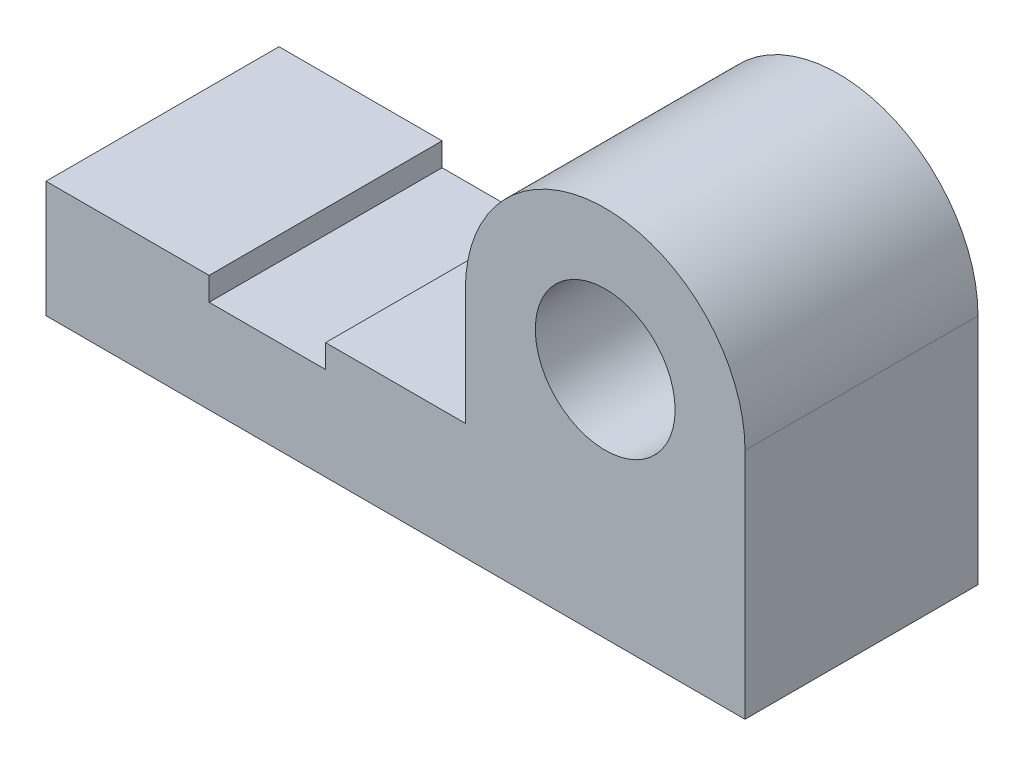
ISO-10303-21;
HEADER;
FILE_DESCRIPTION(('STEP AP214'),'2;1');
FILE_NAME('part.step','',(''),(''),'','','');
FILE_SCHEMA(('AUTOMOTIVE_DESIGN { 1 0 10303 214 1 1 1 1 }'));
ENDSEC;
DATA;
#1=APPLICATION_CONTEXT('core data for automotive mechanical design processes');
#2=APPLICATION_PROTOCOL_DEFINITION('international standard','automotive_design',2000,#1);
#3=PRODUCT_CONTEXT('',#1,'mechanical');
#4=PRODUCT('Part','Part','',(#3));
#5=PRODUCT_RELATED_PRODUCT_CATEGORY('part','',(#4));
#6=PRODUCT_DEFINITION_FORMATION('','',#4);
#7=PRODUCT_DEFINITION_CONTEXT('part definition',#1,'design');
#8=PRODUCT_DEFINITION('design','',#6,#7);
#9=PRODUCT_DEFINITION_SHAPE('','',#8);
#10=(LENGTH_UNIT() NAMED_UNIT(*) SI_UNIT(.MILLI.,.METRE.));
#11=(NAMED_UNIT(*) PLANE_ANGLE_UNIT() SI_UNIT($,.RADIAN.));
#12=(NAMED_UNIT(*) SI_UNIT($,.STERADIAN.) SOLID_ANGLE_UNIT());
#13=UNCERTAINTY_MEASURE_WITH_UNIT(LENGTH_MEASURE(1.E-05),#10,'distance_accuracy_value','');
#14=(GEOMETRIC_REPRESENTATION_CONTEXT(3) GLOBAL_UNCERTAINTY_ASSIGNED_CONTEXT((#13)) GLOBAL_UNIT_ASSIGNED_CONTEXT((#10,
#11,#12)) REPRESENTATION_CONTEXT('',''));
#15=CARTESIAN_POINT('',(0.,0.,0.));
#16=DIRECTION('',(0.,0.,1.));
#17=DIRECTION('',(1.,0.,0.));
#18=AXIS2_PLACEMENT_3D('',#15,#16,#17);
#19=CARTESIAN_POINT('',(240.,100.,100.));
#20=DIRECTION('',(0.,0.,1.));
#21=DIRECTION('',(1.,0.,0.));
#22=AXIS2_PLACEMENT_3D('',#19,#20,#21);
#23=PLANE('',#22);
#24=DIRECTION('',(0.,-1.,0.));
#25=VECTOR('',#24,1.);
#26=CARTESIAN_POINT('',(120.,50.,100.));
#27=LINE('',#26,#25);
#28=CARTESIAN_POINT('',(120.,50.,100.));
#29=VERTEX_POINT('',#28);
#30=CARTESIAN_POINT('',(120.,40.,100.));
#31=VERTEX_POINT('',#30);
#32=EDGE_CURVE('E193',#29,#31,#27,.T.);
#33=ORIENTED_EDGE('',*,*,#32,.T.);
#34=DIRECTION('',(-1.,0.,0.));
#35=VECTOR('',#34,1.);
#36=CARTESIAN_POINT('',(120.,40.,100.));
#37=LINE('',#36,#35);
#38=CARTESIAN_POINT('',(70.,40.,100.));
#39=VERTEX_POINT('',#38);
#40=EDGE_CURVE('E131',#31,#39,#37,.T.);
#41=ORIENTED_EDGE('',*,*,#40,.T.);
#42=DIRECTION('',(0.,1.,0.));
#43=VECTOR('',#42,1.);
#44=CARTESIAN_POINT('',(70.,40.,100.));
#45=LINE('',#44,#43);
#46=CARTESIAN_POINT('',(70.,50.,100.));
#47=VERTEX_POINT('',#46);
#48=EDGE_CURVE('E214',#39,#47,#45,.T.);
#49=ORIENTED_EDGE('',*,*,#48,.T.);
#50=DIRECTION('',(-1.,0.,0.));
#51=VECTOR('',#50,1.);
#52=CARTESIAN_POINT('',(70.,50.,100.));
#53=LINE('',#52,#51);
#54=CARTESIAN_POINT('',(0.,50.,100.));
#55=VERTEX_POINT('',#54);
#56=EDGE_CURVE('E233',#47,#55,#53,.T.);
#57=ORIENTED_EDGE('',*,*,#56,.T.);
#58=DIRECTION('',(0.,-1.,0.));
#59=VECTOR('',#58,1.);
#60=CARTESIAN_POINT('',(0.,50.,100.));
#61=LINE('',#60,#59);
#62=CARTESIAN_POINT('',(0.,0.,100.));
#63=VERTEX_POINT('',#62);
#64=EDGE_CURVE('E230',#55,#63,#61,.T.);
#65=ORIENTED_EDGE('',*,*,#64,.T.);
#66=DIRECTION('',(1.,0.,0.));
#67=VECTOR('',#66,1.);
#68=CARTESIAN_POINT('',(0.,0.,100.));
#69=LINE('',#68,#67);
#70=CARTESIAN_POINT('',(300.,0.,100.));
#71=VERTEX_POINT('',#70);
#72=EDGE_CURVE('E232',#63,#71,#69,.T.);
#73=ORIENTED_EDGE('',*,*,#72,.T.);
#74=DIRECTION('',(0.,1.,0.));
#75=VECTOR('',#74,1.);
#76=CARTESIAN_POINT('',(300.,0.,100.));
#77=LINE('',#76,#75);
#78=CARTESIAN_POINT('',(300.,100.,100.));
#79=VERTEX_POINT('',#78);
#80=EDGE_CURVE('E156',#71,#79,#77,.T.);
#81=ORIENTED_EDGE('',*,*,#80,.T.);
#82=CARTESIAN_POINT('',(240.,100.,100.));
#83=DIRECTION('',(0.,0.,1.));
#84=DIRECTION('',(1.,0.,0.));
#85=AXIS2_PLACEMENT_3D('',#82,#83,#84);
#86=CIRCLE('',#85,59.9999999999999);
#87=CARTESIAN_POINT('',(180.,100.,100.));
#88=VERTEX_POINT('',#87);
#89=EDGE_CURVE('E150',#79,#88,#86,.T.);
#90=ORIENTED_EDGE('',*,*,#89,.T.);
#91=DIRECTION('',(0.,-1.,0.));
#92=VECTOR('',#91,1.);
#93=CARTESIAN_POINT('',(180.,100.,100.));
#94=LINE('',#93,#92);
#95=CARTESIAN_POINT('',(180.,50.,100.));
#96=VERTEX_POINT('',#95);
#97=EDGE_CURVE('E154',#88,#96,#94,.T.);
#98=ORIENTED_EDGE('',*,*,#97,.T.);
#99=DIRECTION('',(-1.,0.,0.));
#100=VECTOR('',#99,1.);
#101=CARTESIAN_POINT('',(180.,50.,100.));
#102=LINE('',#101,#100);
#103=EDGE_CURVE('E82',#96,#29,#102,.T.);
#104=ORIENTED_EDGE('',*,*,#103,.T.);
#105=EDGE_LOOP('',(#33,#41,#49,#57,#65,#73,#81,#90,#98,#104));
#106=FACE_BOUND('',#105,.T.);
#107=CARTESIAN_POINT('',(240.,100.,100.));
#108=DIRECTION('',(0.,0.,1.));
#109=DIRECTION('',(1.,0.,0.));
#110=AXIS2_PLACEMENT_3D('',#107,#108,#109);
#111=CIRCLE('',#110,30.);
#112=CARTESIAN_POINT('',(270.,100.,100.));
#113=VERTEX_POINT('',#112);
#114=EDGE_CURVE('E178',#113,#113,#111,.T.);
#115=ORIENTED_EDGE('',*,*,#114,.F.);
#116=EDGE_LOOP('',(#115));
#117=FACE_BOUND('',#116,.T.);
#118=ADVANCED_FACE('F65',(#106,#117),#23,.T.);
#119=CARTESIAN_POINT('',(240.,100.,0.));
#120=DIRECTION('',(0.,0.,1.));
#121=DIRECTION('',(1.,0.,0.));
#122=AXIS2_PLACEMENT_3D('',#119,#120,#121);
#123=PLANE('',#122);
#124=DIRECTION('',(0.,-1.,0.));
#125=VECTOR('',#124,1.);
#126=CARTESIAN_POINT('',(120.,50.,0.));
#127=LINE('',#126,#125);
#128=CARTESIAN_POINT('',(120.,50.,0.));
#129=VERTEX_POINT('',#128);
#130=CARTESIAN_POINT('',(120.,40.,0.));
#131=VERTEX_POINT('',#130);
#132=EDGE_CURVE('E174',#129,#131,#127,.T.);
#133=ORIENTED_EDGE('',*,*,#132,.F.);
#134=DIRECTION('',(-1.,0.,0.));
#135=VECTOR('',#134,1.);
#136=CARTESIAN_POINT('',(180.,50.,0.));
#137=LINE('',#136,#135);
#138=CARTESIAN_POINT('',(180.,50.,0.));
#139=VERTEX_POINT('',#138);
#140=EDGE_CURVE('E123',#139,#129,#137,.T.);
#141=ORIENTED_EDGE('',*,*,#140,.F.);
#142=DIRECTION('',(0.,-1.,0.));
#143=VECTOR('',#142,1.);
#144=CARTESIAN_POINT('',(180.,100.,0.));
#145=LINE('',#144,#143);
#146=CARTESIAN_POINT('',(180.,100.,0.));
#147=VERTEX_POINT('',#146);
#148=EDGE_CURVE('E117',#147,#139,#145,.T.);
#149=ORIENTED_EDGE('',*,*,#148,.F.);
#150=CARTESIAN_POINT('',(240.,100.,0.));
#151=DIRECTION('',(0.,0.,1.));
#152=DIRECTION('',(1.,0.,0.));
#153=AXIS2_PLACEMENT_3D('',#150,#151,#152);
#154=CIRCLE('',#153,59.9999999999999);
#155=CARTESIAN_POINT('',(300.,100.,0.));
#156=VERTEX_POINT('',#155);
#157=EDGE_CURVE('E164',#156,#147,#154,.T.);
#158=ORIENTED_EDGE('',*,*,#157,.F.);
#159=DIRECTION('',(0.,1.,0.));
#160=VECTOR('',#159,1.);
#161=CARTESIAN_POINT('',(300.,0.,0.));
#162=LINE('',#161,#160);
#163=CARTESIAN_POINT('',(300.,0.,0.));
#164=VERTEX_POINT('',#163);
#165=EDGE_CURVE('E188',#164,#156,#162,.T.);
#166=ORIENTED_EDGE('',*,*,#165,.F.);
#167=DIRECTION('',(1.,0.,0.));
#168=VECTOR('',#167,1.);
#169=CARTESIAN_POINT('',(0.,0.,0.));
#170=LINE('',#169,#168);
#171=CARTESIAN_POINT('',(0.,0.,0.));
#172=VERTEX_POINT('',#171);
#173=EDGE_CURVE('E186',#172,#164,#170,.T.);
#174=ORIENTED_EDGE('',*,*,#173,.F.);
#175=DIRECTION('',(0.,-1.,0.));
#176=VECTOR('',#175,1.);
#177=CARTESIAN_POINT('',(0.,50.,0.));
#178=LINE('',#177,#176);
#179=CARTESIAN_POINT('',(0.,50.,0.));
#180=VERTEX_POINT('',#179);
#181=EDGE_CURVE('E184',#180,#172,#178,.T.);
#182=ORIENTED_EDGE('',*,*,#181,.F.);
#183=DIRECTION('',(-1.,0.,0.));
#184=VECTOR('',#183,1.);
#185=CARTESIAN_POINT('',(70.,50.,0.));
#186=LINE('',#185,#184);
#187=CARTESIAN_POINT('',(70.,50.,0.));
#188=VERTEX_POINT('',#187);
#189=EDGE_CURVE('E182',#188,#180,#186,.T.);
#190=ORIENTED_EDGE('',*,*,#189,.F.);
#191=DIRECTION('',(0.,1.,0.));
#192=VECTOR('',#191,1.);
#193=CARTESIAN_POINT('',(70.,40.,0.));
#194=LINE('',#193,#192);
#195=CARTESIAN_POINT('',(70.,40.,0.));
#196=VERTEX_POINT('',#195);
#197=EDGE_CURVE('E180',#196,#188,#194,.T.);
#198=ORIENTED_EDGE('',*,*,#197,.F.);
#199=DIRECTION('',(-1.,0.,0.));
#200=VECTOR('',#199,1.);
#201=CARTESIAN_POINT('',(120.,40.,0.));
#202=LINE('',#201,#200);
#203=EDGE_CURVE('E177',#131,#196,#202,.T.);
#204=ORIENTED_EDGE('',*,*,#203,.F.);
#205=EDGE_LOOP('',(#133,#141,#149,#158,#166,#174,#182,#190,#198,#204));
#206=FACE_BOUND('',#205,.T.);
#207=CARTESIAN_POINT('',(240.,100.,0.));
#208=DIRECTION('',(0.,0.,1.));
#209=DIRECTION('',(1.,0.,0.));
#210=AXIS2_PLACEMENT_3D('',#207,#208,#209);
#211=CIRCLE('',#210,30.);
#212=CARTESIAN_POINT('',(270.,100.,0.));
#213=VERTEX_POINT('',#212);
#214=EDGE_CURVE('E241',#213,#213,#211,.T.);
#215=ORIENTED_EDGE('',*,*,#214,.T.);
#216=EDGE_LOOP('',(#215));
#217=FACE_BOUND('',#216,.T.);
#218=ADVANCED_FACE('F218',(#206,#217),#123,.F.);
#219=CARTESIAN_POINT('',(120.,50.,100.));
#220=DIRECTION('',(1.,0.,0.));
#221=DIRECTION('',(0.,0.,-1.));
#222=AXIS2_PLACEMENT_3D('',#219,#220,#221);
#223=PLANE('',#222);
#224=ORIENTED_EDGE('',*,*,#132,.T.);
#225=DIRECTION('',(0.,0.,-1.));
#226=VECTOR('',#225,1.);
#227=CARTESIAN_POINT('',(120.,40.,100.));
#228=LINE('',#227,#226);
#229=EDGE_CURVE('E12',#31,#131,#228,.T.);
#230=ORIENTED_EDGE('',*,*,#229,.F.);
#231=ORIENTED_EDGE('',*,*,#32,.F.);
#232=DIRECTION('',(0.,0.,-1.));
#233=VECTOR('',#232,1.);
#234=CARTESIAN_POINT('',(120.,50.,100.));
#235=LINE('',#234,#233);
#236=EDGE_CURVE('E170',#29,#129,#235,.T.);
#237=ORIENTED_EDGE('',*,*,#236,.T.);
#238=EDGE_LOOP('',(#224,#230,#231,#237));
#239=FACE_BOUND('',#238,.T.);
#240=ADVANCED_FACE('F67',(#239),#223,.F.);
#241=CARTESIAN_POINT('',(120.,40.,100.));
#242=DIRECTION('',(0.,-1.,0.));
#243=DIRECTION('',(1.,0.,0.));
#244=AXIS2_PLACEMENT_3D('',#241,#242,#243);
#245=PLANE('',#244);
#246=ORIENTED_EDGE('',*,*,#203,.T.);
#247=DIRECTION('',(0.,0.,-1.));
#248=VECTOR('',#247,1.);
#249=CARTESIAN_POINT('',(70.,40.,100.));
#250=LINE('',#249,#248);
#251=EDGE_CURVE('E74',#39,#196,#250,.T.);
#252=ORIENTED_EDGE('',*,*,#251,.F.);
#253=ORIENTED_EDGE('',*,*,#40,.F.);
#254=ORIENTED_EDGE('',*,*,#229,.T.);
#255=EDGE_LOOP('',(#246,#252,#253,#254));
#256=FACE_BOUND('',#255,.T.);
#257=ADVANCED_FACE('F277',(#256),#245,.F.);
#258=CARTESIAN_POINT('',(70.,40.,100.));
#259=DIRECTION('',(-1.,0.,0.));
#260=DIRECTION('',(0.,0.,1.));
#261=AXIS2_PLACEMENT_3D('',#258,#259,#260);
#262=PLANE('',#261);
#263=ORIENTED_EDGE('',*,*,#197,.T.);
#264=DIRECTION('',(0.,0.,-1.));
#265=VECTOR('',#264,1.);
#266=CARTESIAN_POINT('',(70.,50.,100.));
#267=LINE('',#266,#265);
#268=EDGE_CURVE('E206',#47,#188,#267,.T.);
#269=ORIENTED_EDGE('',*,*,#268,.F.);
#270=ORIENTED_EDGE('',*,*,#48,.F.);
#271=ORIENTED_EDGE('',*,*,#251,.T.);
#272=EDGE_LOOP('',(#263,#269,#270,#271));
#273=FACE_BOUND('',#272,.T.);
#274=ADVANCED_FACE('F212',(#273),#262,.F.);
#275=CARTESIAN_POINT('',(70.,50.,100.));
#276=DIRECTION('',(0.,-1.,0.));
#277=DIRECTION('',(0.,0.,-1.));
#278=AXIS2_PLACEMENT_3D('',#275,#276,#277);
#279=PLANE('',#278);
#280=ORIENTED_EDGE('',*,*,#189,.T.);
#281=DIRECTION('',(0.,0.,-1.));
#282=VECTOR('',#281,1.);
#283=CARTESIAN_POINT('',(0.,50.,100.));
#284=LINE('',#283,#282);
#285=EDGE_CURVE('E203',#55,#180,#284,.T.);
#286=ORIENTED_EDGE('',*,*,#285,.F.);
#287=ORIENTED_EDGE('',*,*,#56,.F.);
#288=ORIENTED_EDGE('',*,*,#268,.T.);
#289=EDGE_LOOP('',(#280,#286,#287,#288));
#290=FACE_BOUND('',#289,.T.);
#291=ADVANCED_FACE('F224',(#290),#279,.F.);
#292=CARTESIAN_POINT('',(0.,50.,100.));
#293=DIRECTION('',(1.,0.,0.));
#294=DIRECTION('',(0.,0.,-1.));
#295=AXIS2_PLACEMENT_3D('',#292,#293,#294);
#296=PLANE('',#295);
#297=ORIENTED_EDGE('',*,*,#181,.T.);
#298=DIRECTION('',(0.,0.,-1.));
#299=VECTOR('',#298,1.);
#300=CARTESIAN_POINT('',(0.,0.,100.));
#301=LINE('',#300,#299);
#302=EDGE_CURVE('E200',#63,#172,#301,.T.);
#303=ORIENTED_EDGE('',*,*,#302,.F.);
#304=ORIENTED_EDGE('',*,*,#64,.F.);
#305=ORIENTED_EDGE('',*,*,#285,.T.);
#306=EDGE_LOOP('',(#297,#303,#304,#305));
#307=FACE_BOUND('',#306,.T.);
#308=ADVANCED_FACE('F228',(#307),#296,.F.);
#309=CARTESIAN_POINT('',(0.,0.,100.));
#310=DIRECTION('',(0.,1.,0.));
#311=DIRECTION('',(0.,0.,1.));
#312=AXIS2_PLACEMENT_3D('',#309,#310,#311);
#313=PLANE('',#312);
#314=ORIENTED_EDGE('',*,*,#173,.T.);
#315=DIRECTION('',(0.,0.,-1.));
#316=VECTOR('',#315,1.);
#317=CARTESIAN_POINT('',(300.,0.,100.));
#318=LINE('',#317,#316);
#319=EDGE_CURVE('E197',#71,#164,#318,.T.);
#320=ORIENTED_EDGE('',*,*,#319,.F.);
#321=ORIENTED_EDGE('',*,*,#72,.F.);
#322=ORIENTED_EDGE('',*,*,#302,.T.);
#323=EDGE_LOOP('',(#314,#320,#321,#322));
#324=FACE_BOUND('',#323,.T.);
#325=ADVANCED_FACE('F267',(#324),#313,.F.);
#326=CARTESIAN_POINT('',(300.,0.,100.));
#327=DIRECTION('',(-1.,0.,0.));
#328=DIRECTION('',(0.,0.,1.));
#329=AXIS2_PLACEMENT_3D('',#326,#327,#328);
#330=PLANE('',#329);
#331=ORIENTED_EDGE('',*,*,#165,.T.);
#332=DIRECTION('',(0.,0.,-1.));
#333=VECTOR('',#332,1.);
#334=CARTESIAN_POINT('',(300.,100.,100.));
#335=LINE('',#334,#333);
#336=EDGE_CURVE('E165',#79,#156,#335,.T.);
#337=ORIENTED_EDGE('',*,*,#336,.F.);
#338=ORIENTED_EDGE('',*,*,#80,.F.);
#339=ORIENTED_EDGE('',*,*,#319,.T.);
#340=EDGE_LOOP('',(#331,#337,#338,#339));
#341=FACE_BOUND('',#340,.T.);
#342=ADVANCED_FACE('F264',(#341),#330,.F.);
#343=CARTESIAN_POINT('',(240.,100.,100.));
#344=DIRECTION('',(0.,0.,-1.));
#345=DIRECTION('',(-1.,0.,0.));
#346=AXIS2_PLACEMENT_3D('',#343,#344,#345);
#347=CYLINDRICAL_SURFACE('',#346,59.9999999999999);
#348=ORIENTED_EDGE('',*,*,#157,.T.);
#349=DIRECTION('',(0.,0.,-1.));
#350=VECTOR('',#349,1.);
#351=CARTESIAN_POINT('',(180.,100.,100.));
#352=LINE('',#351,#350);
#353=EDGE_CURVE('E161',#88,#147,#352,.T.);
#354=ORIENTED_EDGE('',*,*,#353,.F.);
#355=ORIENTED_EDGE('',*,*,#89,.F.);
#356=ORIENTED_EDGE('',*,*,#336,.T.);
#357=EDGE_LOOP('',(#348,#354,#355,#356));
#358=FACE_BOUND('',#357,.T.);
#359=ADVANCED_FACE('F162',(#358),#347,.T.);
#360=CARTESIAN_POINT('',(180.,100.,100.));
#361=DIRECTION('',(1.,0.,0.));
#362=DIRECTION('',(0.,1.,0.));
#363=AXIS2_PLACEMENT_3D('',#360,#361,#362);
#364=PLANE('',#363);
#365=ORIENTED_EDGE('',*,*,#148,.T.);
#366=DIRECTION('',(0.,0.,-1.));
#367=VECTOR('',#366,1.);
#368=CARTESIAN_POINT('',(180.,50.,100.));
#369=LINE('',#368,#367);
#370=EDGE_CURVE('E166',#96,#139,#369,.T.);
#371=ORIENTED_EDGE('',*,*,#370,.F.);
#372=ORIENTED_EDGE('',*,*,#97,.F.);
#373=ORIENTED_EDGE('',*,*,#353,.T.);
#374=EDGE_LOOP('',(#365,#371,#372,#373));
#375=FACE_BOUND('',#374,.T.);
#376=ADVANCED_FACE('F168',(#375),#364,.F.);
#377=CARTESIAN_POINT('',(180.,50.,100.));
#378=DIRECTION('',(0.,-1.,0.));
#379=DIRECTION('',(0.,0.,-1.));
#380=AXIS2_PLACEMENT_3D('',#377,#378,#379);
#381=PLANE('',#380);
#382=ORIENTED_EDGE('',*,*,#140,.T.);
#383=ORIENTED_EDGE('',*,*,#236,.F.);
#384=ORIENTED_EDGE('',*,*,#103,.F.);
#385=ORIENTED_EDGE('',*,*,#370,.T.);
#386=EDGE_LOOP('',(#382,#383,#384,#385));
#387=FACE_BOUND('',#386,.T.);
#388=ADVANCED_FACE('F257',(#387),#381,.F.);
#389=CARTESIAN_POINT('',(240.,100.,100.));
#390=DIRECTION('',(0.,0.,-1.));
#391=DIRECTION('',(-1.,0.,0.));
#392=AXIS2_PLACEMENT_3D('',#389,#390,#391);
#393=CYLINDRICAL_SURFACE('',#392,30.);
#394=ORIENTED_EDGE('',*,*,#114,.T.);
#395=EDGE_LOOP('',(#394));
#396=FACE_BOUND('',#395,.T.);
#397=ORIENTED_EDGE('',*,*,#214,.F.);
#398=EDGE_LOOP('',(#397));
#399=FACE_BOUND('',#398,.T.);
#400=ADVANCED_FACE('F247',(#396,#399),#393,.F.);
#401=CLOSED_SHELL('',(#118,#218,#240,#257,#274,#291,#308,#325,#342,#359,#376,#388,#400));
#402=MANIFOLD_SOLID_BREP('B2',#401);
#403=ADVANCED_BREP_SHAPE_REPRESENTATION('',(#18,#402),#14);
#404=SHAPE_DEFINITION_REPRESENTATION(#9,#403);
ENDSEC;
END-ISO-10303-21;
